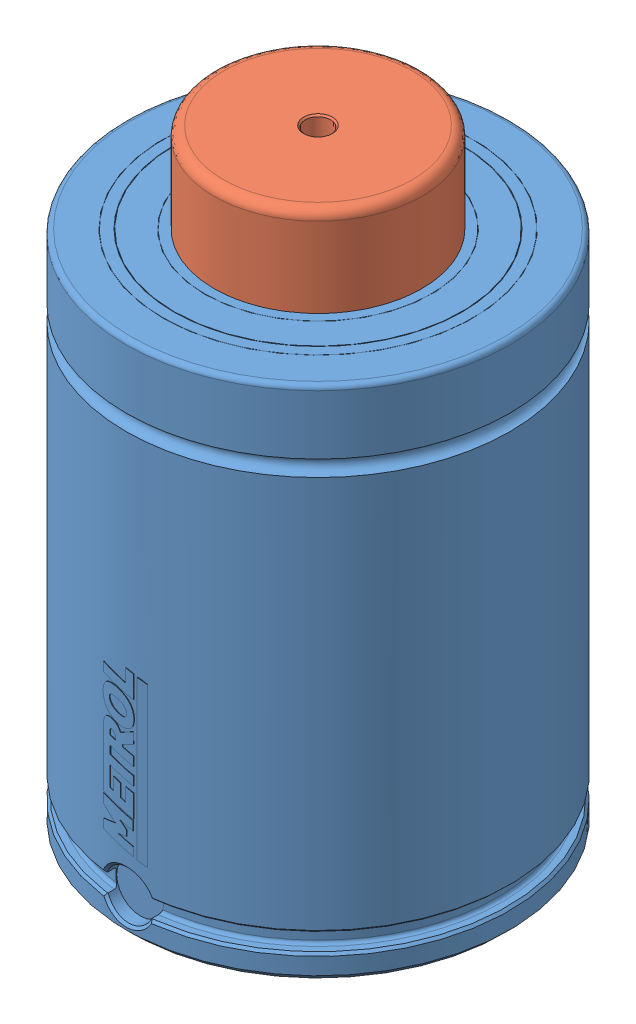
SolidWorks assembly ISNG5000-025.SLDASM, configuration Default (file format 7000). Lengths in mm.
Overall size (120 190 120.11).
2 component instances, 2 part files, 5 mates.
Components (placement in the parent):
- ISNG-5000 Body-1: ISNG-5000 Body.SLDPRT [ISNG-5000-25] x (0 0 1) z (0 -1 0) size (120.11 120 162)
- ISNG-5000 Piston-1: ISNG-5000 Piston.SLDPRT [ISNG-5000-25] at (0 137 0) x (0.241422 0 -0.97042) z (0 -1 0) size (85 85 53)
Mates (geometry in assembly coordinates):
- Concentric1: concentric aligned: cylinder of ISNG-5000 Body-1 through (0 0 0) axis (0 -1 0) radius 32.5; cylinder of ISNG-5000 Piston-1 through (0 137 0) axis (0 -1 0) radius 32.5
- LimitDistance1: limit distance anti-aligned: plane of ISNG-5000 Piston-1 through (41.2429 142 10.2604) normal (0 1 0); plane of ISNG-5000 Body-1 through (-32.5 142 0) normal (0 -1 0)
- Coincident1: coincident anti-aligned: plane of ISNG-5000 Body-1 through (0 0 0) normal (0 -1 0); plane of assembly through (0 0 0) normal (0 1 0)
- Coincident2: coincident aligned: plane of ISNG-5000 Body-1; plane of assembly through (0 0 0) normal (0 0 1)
- Coincident4: coincident anti-aligned: plane of ISNG-5000 Body-1; plane of assembly through (0 0 0) normal (1 0 0)
